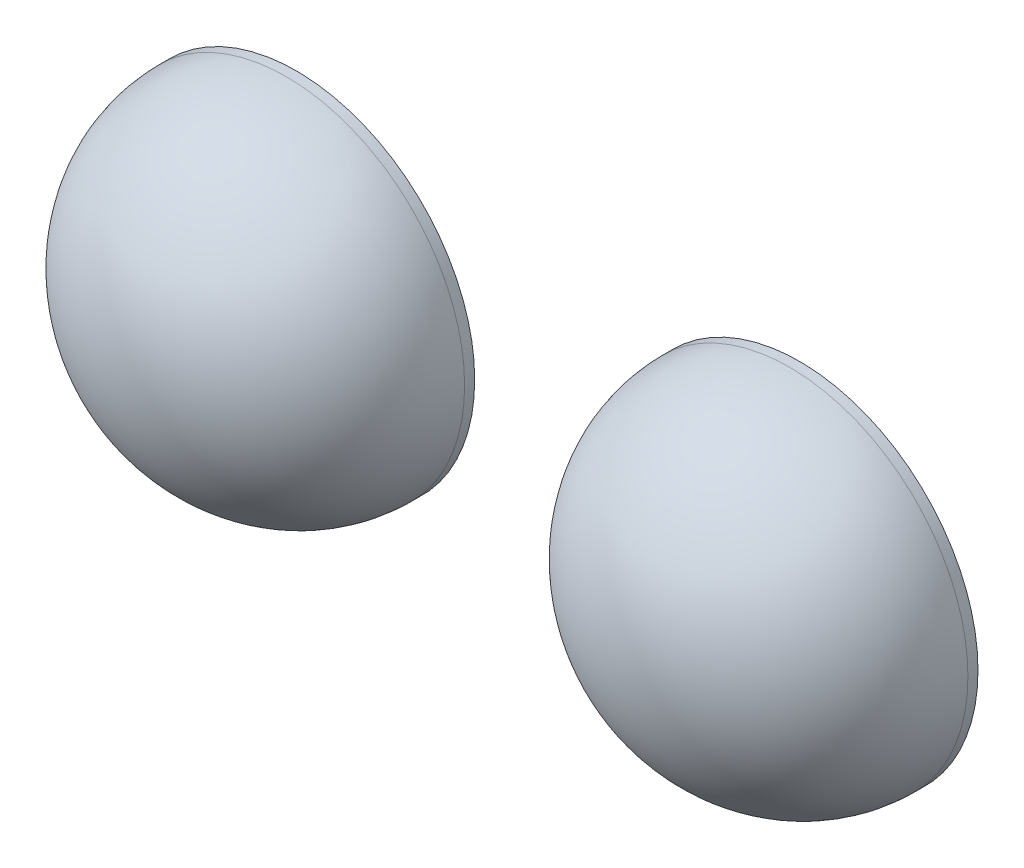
ISO-10303-21;
HEADER;
FILE_DESCRIPTION(('STEP AP214'),'2;1');
FILE_NAME('part.step','',(''),(''),'','','');
FILE_SCHEMA(('AUTOMOTIVE_DESIGN { 1 0 10303 214 1 1 1 1 }'));
ENDSEC;
DATA;
#1=APPLICATION_CONTEXT('core data for automotive mechanical design processes');
#2=APPLICATION_PROTOCOL_DEFINITION('international standard','automotive_design',2000,#1);
#3=PRODUCT_CONTEXT('',#1,'mechanical');
#4=PRODUCT('Part','Part','',(#3));
#5=PRODUCT_RELATED_PRODUCT_CATEGORY('part','',(#4));
#6=PRODUCT_DEFINITION_FORMATION('','',#4);
#7=PRODUCT_DEFINITION_CONTEXT('part definition',#1,'design');
#8=PRODUCT_DEFINITION('design','',#6,#7);
#9=PRODUCT_DEFINITION_SHAPE('','',#8);
#10=(LENGTH_UNIT() NAMED_UNIT(*) SI_UNIT(.MILLI.,.METRE.));
#11=(NAMED_UNIT(*) PLANE_ANGLE_UNIT() SI_UNIT($,.RADIAN.));
#12=(NAMED_UNIT(*) SI_UNIT($,.STERADIAN.) SOLID_ANGLE_UNIT());
#13=UNCERTAINTY_MEASURE_WITH_UNIT(LENGTH_MEASURE(1.E-05),#10,'distance_accuracy_value','');
#14=(GEOMETRIC_REPRESENTATION_CONTEXT(3) GLOBAL_UNCERTAINTY_ASSIGNED_CONTEXT((#13)) GLOBAL_UNIT_ASSIGNED_CONTEXT((#10,
#11,#12)) REPRESENTATION_CONTEXT('',''));
#15=CARTESIAN_POINT('',(0.,0.,0.));
#16=DIRECTION('',(0.,0.,1.));
#17=DIRECTION('',(1.,0.,0.));
#18=AXIS2_PLACEMENT_3D('',#15,#16,#17);
#19=CARTESIAN_POINT('',(-12.5,0.,0.5));
#20=DIRECTION('',(0.,0.,-1.));
#21=DIRECTION('',(-1.,0.,0.));
#22=AXIS2_PLACEMENT_3D('',#19,#20,#21);
#23=CYLINDRICAL_SURFACE('',#22,8.85849528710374);
#24=CARTESIAN_POINT('',(-12.5,0.,0.5));
#25=DIRECTION('',(0.,0.,1.));
#26=DIRECTION('',(1.,0.,0.));
#27=AXIS2_PLACEMENT_3D('',#24,#25,#26);
#28=CIRCLE('',#27,8.85849528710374);
#29=CARTESIAN_POINT('',(-3.64150471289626,0.,0.5));
#30=VERTEX_POINT('',#29);
#31=EDGE_CURVE('E12',#30,#30,#28,.T.);
#32=ORIENTED_EDGE('',*,*,#31,.F.);
#33=EDGE_LOOP('',(#32));
#34=FACE_BOUND('',#33,.T.);
#35=CARTESIAN_POINT('',(-12.5,0.,0.));
#36=DIRECTION('',(0.,0.,1.));
#37=DIRECTION('',(1.,0.,0.));
#38=AXIS2_PLACEMENT_3D('',#35,#36,#37);
#39=CIRCLE('',#38,8.85849528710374);
#40=CARTESIAN_POINT('',(-3.64150471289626,0.,0.));
#41=VERTEX_POINT('',#40);
#42=EDGE_CURVE('E49',#41,#41,#39,.T.);
#43=ORIENTED_EDGE('',*,*,#42,.T.);
#44=EDGE_LOOP('',(#43));
#45=FACE_BOUND('',#44,.T.);
#46=ADVANCED_FACE('F41',(#34,#45),#23,.T.);
#47=CARTESIAN_POINT('',(-12.5,0.,0.5));
#48=DIRECTION('',(0.,1.,0.));
#49=DIRECTION('',(1.,0.,0.));
#50=AXIS2_PLACEMENT_3D('',#47,#48,#49);
#51=ELLIPSE('',#50,8.85849528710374,8.);
#52=TRIMMED_CURVE('',#51,(PARAMETER_VALUE(4.71238898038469)),
(PARAMETER_VALUE(7.85398163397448)),.T.,.PARAMETER.);
#53=CARTESIAN_POINT('',(-12.5,0.,-7.5));
#54=DIRECTION('',(0.,0.,1.));
#55=AXIS1_PLACEMENT('',#53,#54);
#56=SURFACE_OF_REVOLUTION('',#52,#55);
#57=CARTESIAN_POINT('',(-12.5,0.,8.5));
#58=VERTEX_POINT('',#57);
#59=VERTEX_LOOP('',#58);
#60=FACE_BOUND('',#59,.T.);
#61=ORIENTED_EDGE('',*,*,#31,.T.);
#62=EDGE_LOOP('',(#61));
#63=FACE_BOUND('',#62,.T.);
#64=ADVANCED_FACE('F43',(#60,#63),#56,.F.);
#65=CARTESIAN_POINT('',(-12.5,0.,0.));
#66=DIRECTION('',(0.,0.,1.));
#67=DIRECTION('',(1.,0.,0.));
#68=AXIS2_PLACEMENT_3D('',#65,#66,#67);
#69=PLANE('',#68);
#70=ORIENTED_EDGE('',*,*,#42,.F.);
#71=EDGE_LOOP('',(#70));
#72=FACE_BOUND('',#71,.T.);
#73=ADVANCED_FACE('F54',(#72),#69,.F.);
#74=CLOSED_SHELL('',(#46,#64,#73));
#75=MANIFOLD_SOLID_BREP('B2',#74);
#76=CARTESIAN_POINT('',(12.5,0.,0.5));
#77=DIRECTION('',(0.,0.,-1.));
#78=DIRECTION('',(-1.,0.,0.));
#79=AXIS2_PLACEMENT_3D('',#76,#77,#78);
#80=CYLINDRICAL_SURFACE('',#79,8.85849528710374);
#81=CARTESIAN_POINT('',(12.5,0.,0.5));
#82=DIRECTION('',(0.,0.,1.));
#83=DIRECTION('',(1.,0.,0.));
#84=AXIS2_PLACEMENT_3D('',#81,#82,#83);
#85=CIRCLE('',#84,8.85849528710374);
#86=CARTESIAN_POINT('',(21.3584952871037,0.,0.5));
#87=VERTEX_POINT('',#86);
#88=EDGE_CURVE('E39',#87,#87,#85,.T.);
#89=ORIENTED_EDGE('',*,*,#88,.F.);
#90=EDGE_LOOP('',(#89));
#91=FACE_BOUND('',#90,.T.);
#92=CARTESIAN_POINT('',(12.5,0.,0.));
#93=DIRECTION('',(0.,0.,1.));
#94=DIRECTION('',(1.,0.,0.));
#95=AXIS2_PLACEMENT_3D('',#92,#93,#94);
#96=CIRCLE('',#95,8.85849528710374);
#97=CARTESIAN_POINT('',(21.3584952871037,0.,0.));
#98=VERTEX_POINT('',#97);
#99=EDGE_CURVE('E94',#98,#98,#96,.T.);
#100=ORIENTED_EDGE('',*,*,#99,.T.);
#101=EDGE_LOOP('',(#100));
#102=FACE_BOUND('',#101,.T.);
#103=ADVANCED_FACE('F86',(#91,#102),#80,.T.);
#104=CARTESIAN_POINT('',(12.5,0.,0.5));
#105=DIRECTION('',(0.,1.,0.));
#106=DIRECTION('',(1.,0.,0.));
#107=AXIS2_PLACEMENT_3D('',#104,#105,#106);
#108=ELLIPSE('',#107,8.85849528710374,8.);
#109=TRIMMED_CURVE('',#108,(PARAMETER_VALUE(4.71238898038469)),
(PARAMETER_VALUE(7.85398163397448)),.T.,.PARAMETER.);
#110=CARTESIAN_POINT('',(12.5,0.,-7.5));
#111=DIRECTION('',(0.,0.,1.));
#112=AXIS1_PLACEMENT('',#110,#111);
#113=SURFACE_OF_REVOLUTION('',#109,#112);
#114=CARTESIAN_POINT('',(12.5,0.,8.5));
#115=VERTEX_POINT('',#114);
#116=VERTEX_LOOP('',#115);
#117=FACE_BOUND('',#116,.T.);
#118=ORIENTED_EDGE('',*,*,#88,.T.);
#119=EDGE_LOOP('',(#118));
#120=FACE_BOUND('',#119,.T.);
#121=ADVANCED_FACE('F88',(#117,#120),#113,.F.);
#122=CARTESIAN_POINT('',(12.5,0.,0.));
#123=DIRECTION('',(0.,0.,1.));
#124=DIRECTION('',(1.,0.,0.));
#125=AXIS2_PLACEMENT_3D('',#122,#123,#124);
#126=PLANE('',#125);
#127=ORIENTED_EDGE('',*,*,#99,.F.);
#128=EDGE_LOOP('',(#127));
#129=FACE_BOUND('',#128,.T.);
#130=ADVANCED_FACE('F99',(#129),#126,.F.);
#131=CLOSED_SHELL('',(#103,#121,#130));
#132=MANIFOLD_SOLID_BREP('B6',#131);
#133=ADVANCED_BREP_SHAPE_REPRESENTATION('',(#18,#75,#132),#14);
#134=SHAPE_DEFINITION_REPRESENTATION(#9,#133);
ENDSEC;
END-ISO-10303-21;
